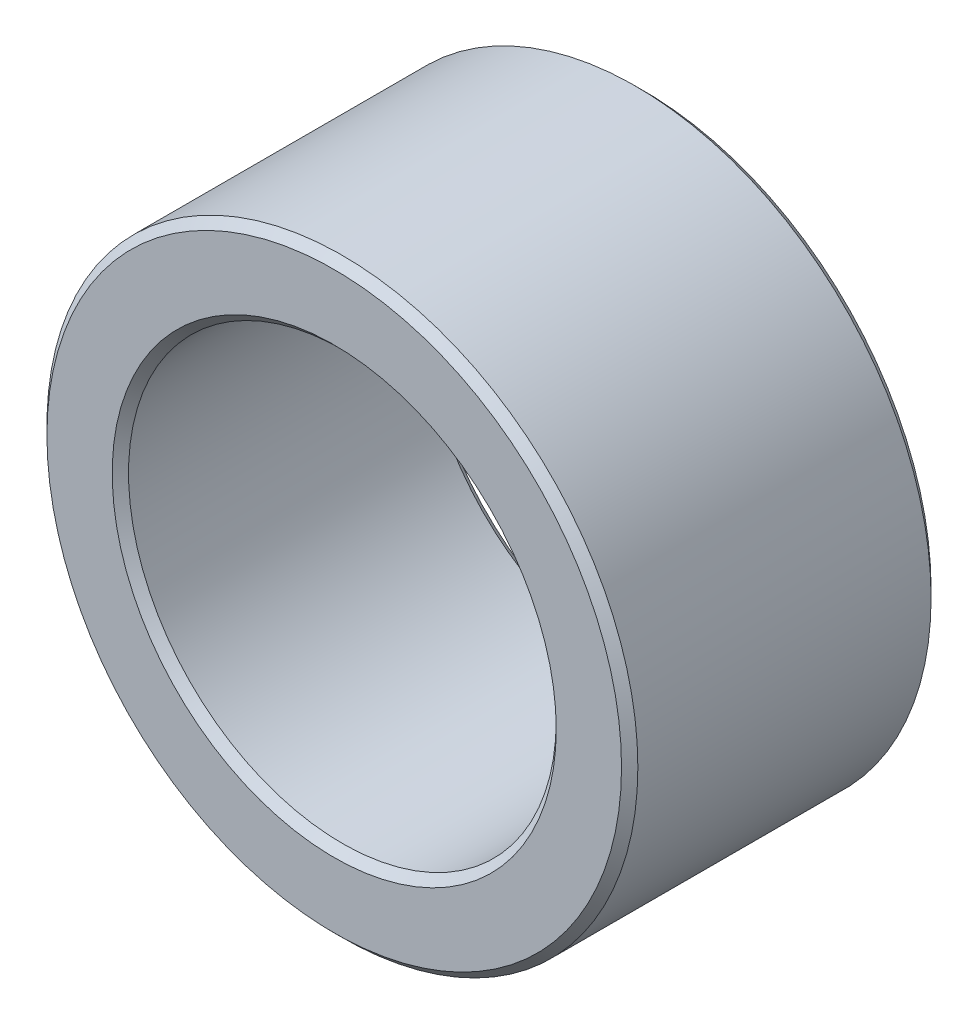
ISO-10303-21;
HEADER;
FILE_DESCRIPTION(('STEP AP214'),'2;1');
FILE_NAME('part.step','',(''),(''),'','','');
FILE_SCHEMA(('AUTOMOTIVE_DESIGN { 1 0 10303 214 1 1 1 1 }'));
ENDSEC;
DATA;
#1=APPLICATION_CONTEXT('core data for automotive mechanical design processes');
#2=APPLICATION_PROTOCOL_DEFINITION('international standard','automotive_design',2000,#1);
#3=PRODUCT_CONTEXT('',#1,'mechanical');
#4=PRODUCT('Part','Part','',(#3));
#5=PRODUCT_RELATED_PRODUCT_CATEGORY('part','',(#4));
#6=PRODUCT_DEFINITION_FORMATION('','',#4);
#7=PRODUCT_DEFINITION_CONTEXT('part definition',#1,'design');
#8=PRODUCT_DEFINITION('design','',#6,#7);
#9=PRODUCT_DEFINITION_SHAPE('','',#8);
#10=(LENGTH_UNIT() NAMED_UNIT(*) SI_UNIT(.MILLI.,.METRE.));
#11=(NAMED_UNIT(*) PLANE_ANGLE_UNIT() SI_UNIT($,.RADIAN.));
#12=(NAMED_UNIT(*) SI_UNIT($,.STERADIAN.) SOLID_ANGLE_UNIT());
#13=UNCERTAINTY_MEASURE_WITH_UNIT(LENGTH_MEASURE(1.E-05),#10,'distance_accuracy_value','');
#14=(GEOMETRIC_REPRESENTATION_CONTEXT(3) GLOBAL_UNCERTAINTY_ASSIGNED_CONTEXT((#13)) GLOBAL_UNIT_ASSIGNED_CONTEXT((#10,
#11,#12)) REPRESENTATION_CONTEXT('',''));
#15=CARTESIAN_POINT('',(0.,0.,0.));
#16=DIRECTION('',(0.,0.,1.));
#17=DIRECTION('',(1.,0.,0.));
#18=AXIS2_PLACEMENT_3D('',#15,#16,#17);
#19=CARTESIAN_POINT('',(0.,0.,-3.4925));
#20=DIRECTION('',(0.,0.,1.));
#21=DIRECTION('',(1.,0.,0.));
#22=AXIS2_PLACEMENT_3D('',#19,#20,#21);
#23=CYLINDRICAL_SURFACE('',#22,6.6675);
#24=CARTESIAN_POINT('',(0.,0.,3.30835));
#25=DIRECTION('',(0.,0.,1.));
#26=DIRECTION('',(1.,0.,0.));
#27=AXIS2_PLACEMENT_3D('',#24,#25,#26);
#28=CIRCLE('',#27,6.6675);
#29=CARTESIAN_POINT('',(6.6675,0.,3.30835));
#30=VERTEX_POINT('',#29);
#31=EDGE_CURVE('E62',#30,#30,#28,.F.);
#32=ORIENTED_EDGE('',*,*,#31,.T.);
#33=EDGE_LOOP('',(#32));
#34=FACE_BOUND('',#33,.T.);
#35=CARTESIAN_POINT('',(0.,0.,-3.30835));
#36=DIRECTION('',(0.,0.,1.));
#37=DIRECTION('',(1.,0.,0.));
#38=AXIS2_PLACEMENT_3D('',#35,#36,#37);
#39=CIRCLE('',#38,6.6675);
#40=CARTESIAN_POINT('',(6.6675,0.,-3.30835));
#41=VERTEX_POINT('',#40);
#42=EDGE_CURVE('E65',#41,#41,#39,.T.);
#43=ORIENTED_EDGE('',*,*,#42,.T.);
#44=EDGE_LOOP('',(#43));
#45=FACE_BOUND('',#44,.T.);
#46=ADVANCED_FACE('F42',(#34,#45),#23,.T.);
#47=CARTESIAN_POINT('',(0.,0.,-3.4925));
#48=DIRECTION('',(0.,0.,1.));
#49=DIRECTION('',(1.,0.,0.));
#50=AXIS2_PLACEMENT_3D('',#47,#48,#49);
#51=PLANE('',#50);
#52=CARTESIAN_POINT('',(0.,0.,-3.4925));
#53=DIRECTION('',(0.,0.,1.));
#54=DIRECTION('',(1.,0.,0.));
#55=AXIS2_PLACEMENT_3D('',#52,#53,#54);
#56=CIRCLE('',#55,6.48335);
#57=CARTESIAN_POINT('',(6.48335,0.,-3.4925));
#58=VERTEX_POINT('',#57);
#59=EDGE_CURVE('E53',#58,#58,#56,.F.);
#60=ORIENTED_EDGE('',*,*,#59,.T.);
#61=EDGE_LOOP('',(#60));
#62=FACE_BOUND('',#61,.T.);
#63=CARTESIAN_POINT('',(0.,0.,-3.4925));
#64=DIRECTION('',(0.,0.,1.));
#65=DIRECTION('',(1.,0.,0.));
#66=AXIS2_PLACEMENT_3D('',#63,#64,#65);
#67=CIRCLE('',#66,5.01015);
#68=CARTESIAN_POINT('',(5.01015,0.,-3.4925));
#69=VERTEX_POINT('',#68);
#70=EDGE_CURVE('E57',#69,#69,#67,.T.);
#71=ORIENTED_EDGE('',*,*,#70,.T.);
#72=EDGE_LOOP('',(#71));
#73=FACE_BOUND('',#72,.T.);
#74=ADVANCED_FACE('F90',(#62,#73),#51,.F.);
#75=CARTESIAN_POINT('',(0.,0.,-3.4925));
#76=DIRECTION('',(0.,0.,1.));
#77=DIRECTION('',(1.,0.,0.));
#78=AXIS2_PLACEMENT_3D('',#75,#76,#77);
#79=CYLINDRICAL_SURFACE('',#78,4.826);
#80=CARTESIAN_POINT('',(0.,0.,3.30835));
#81=DIRECTION('',(0.,0.,1.));
#82=DIRECTION('',(1.,0.,0.));
#83=AXIS2_PLACEMENT_3D('',#80,#81,#82);
#84=CIRCLE('',#83,4.826);
#85=CARTESIAN_POINT('',(4.826,0.,3.30835));
#86=VERTEX_POINT('',#85);
#87=EDGE_CURVE('E10',#86,#86,#84,.T.);
#88=ORIENTED_EDGE('',*,*,#87,.T.);
#89=EDGE_LOOP('',(#88));
#90=FACE_BOUND('',#89,.T.);
#91=CARTESIAN_POINT('',(0.,0.,-3.30835));
#92=DIRECTION('',(0.,0.,1.));
#93=DIRECTION('',(1.,0.,0.));
#94=AXIS2_PLACEMENT_3D('',#91,#92,#93);
#95=CIRCLE('',#94,4.826);
#96=CARTESIAN_POINT('',(4.826,0.,-3.30835));
#97=VERTEX_POINT('',#96);
#98=EDGE_CURVE('E49',#97,#97,#95,.F.);
#99=ORIENTED_EDGE('',*,*,#98,.T.);
#100=EDGE_LOOP('',(#99));
#101=FACE_BOUND('',#100,.T.);
#102=ADVANCED_FACE('F96',(#90,#101),#79,.F.);
#103=CARTESIAN_POINT('',(0.,0.,3.4925));
#104=DIRECTION('',(0.,0.,1.));
#105=DIRECTION('',(1.,0.,0.));
#106=AXIS2_PLACEMENT_3D('',#103,#104,#105);
#107=PLANE('',#106);
#108=CARTESIAN_POINT('',(0.,0.,3.4925));
#109=DIRECTION('',(0.,0.,1.));
#110=DIRECTION('',(1.,0.,0.));
#111=AXIS2_PLACEMENT_3D('',#108,#109,#110);
#112=CIRCLE('',#111,6.48335);
#113=CARTESIAN_POINT('',(6.48335,0.,3.4925));
#114=VERTEX_POINT('',#113);
#115=EDGE_CURVE('E68',#114,#114,#112,.T.);
#116=ORIENTED_EDGE('',*,*,#115,.T.);
#117=EDGE_LOOP('',(#116));
#118=FACE_BOUND('',#117,.T.);
#119=CARTESIAN_POINT('',(0.,0.,3.4925));
#120=DIRECTION('',(0.,0.,1.));
#121=DIRECTION('',(1.,0.,0.));
#122=AXIS2_PLACEMENT_3D('',#119,#120,#121);
#123=CIRCLE('',#122,5.01015);
#124=CARTESIAN_POINT('',(5.01015,0.,3.4925));
#125=VERTEX_POINT('',#124);
#126=EDGE_CURVE('E71',#125,#125,#123,.F.);
#127=ORIENTED_EDGE('',*,*,#126,.T.);
#128=EDGE_LOOP('',(#127));
#129=FACE_BOUND('',#128,.T.);
#130=ADVANCED_FACE('F75',(#118,#129),#107,.T.);
#131=CARTESIAN_POINT('',(0.,0.,3.4925));
#132=DIRECTION('',(0.,0.,-1.));
#133=DIRECTION('',(-1.,0.,0.));
#134=AXIS2_PLACEMENT_3D('',#131,#132,#133);
#135=CONICAL_SURFACE('',#134,6.48335,0.785398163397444);
#136=ORIENTED_EDGE('',*,*,#31,.F.);
#137=EDGE_LOOP('',(#136));
#138=FACE_BOUND('',#137,.T.);
#139=ORIENTED_EDGE('',*,*,#115,.F.);
#140=EDGE_LOOP('',(#139));
#141=FACE_BOUND('',#140,.T.);
#142=ADVANCED_FACE('F86',(#138,#141),#135,.T.);
#143=CARTESIAN_POINT('',(0.,0.,-3.30835));
#144=DIRECTION('',(0.,0.,1.));
#145=DIRECTION('',(1.,0.,0.));
#146=AXIS2_PLACEMENT_3D('',#143,#144,#145);
#147=CONICAL_SURFACE('',#146,6.6675,0.785398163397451);
#148=ORIENTED_EDGE('',*,*,#59,.F.);
#149=EDGE_LOOP('',(#148));
#150=FACE_BOUND('',#149,.T.);
#151=ORIENTED_EDGE('',*,*,#42,.F.);
#152=EDGE_LOOP('',(#151));
#153=FACE_BOUND('',#152,.T.);
#154=ADVANCED_FACE('F80',(#150,#153),#147,.T.);
#155=CARTESIAN_POINT('',(0.,0.,3.30835));
#156=DIRECTION('',(0.,0.,1.));
#157=DIRECTION('',(1.,0.,0.));
#158=AXIS2_PLACEMENT_3D('',#155,#156,#157);
#159=CONICAL_SURFACE('',#158,4.826,0.785398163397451);
#160=CARTESIAN_POINT('',(5.01015,0.,3.4925));
#161=CARTESIAN_POINT('',(5.00823177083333,0.,3.49058177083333));
#162=CARTESIAN_POINT('',(5.00631354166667,0.,3.48866354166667));
#163=CARTESIAN_POINT('',(5.00247708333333,0.,3.48482708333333));
#164=CARTESIAN_POINT('',(5.00055885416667,0.,3.48290885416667));
#165=CARTESIAN_POINT('',(4.99672239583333,0.,3.47907239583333));
#166=CARTESIAN_POINT('',(4.99480416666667,0.,3.47715416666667));
#167=CARTESIAN_POINT('',(4.99096770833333,0.,3.47331770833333));
#168=CARTESIAN_POINT('',(4.98904947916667,0.,3.47139947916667));
#169=CARTESIAN_POINT('',(4.98521302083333,0.,3.46756302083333));
#170=CARTESIAN_POINT('',(4.98329479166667,0.,3.46564479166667));
#171=CARTESIAN_POINT('',(4.97945833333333,0.,3.46180833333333));
#172=CARTESIAN_POINT('',(4.97754010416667,0.,3.45989010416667));
#173=CARTESIAN_POINT('',(4.97370364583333,0.,3.45605364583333));
#174=CARTESIAN_POINT('',(4.97178541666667,0.,3.45413541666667));
#175=CARTESIAN_POINT('',(4.96794895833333,0.,3.45029895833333));
#176=CARTESIAN_POINT('',(4.96603072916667,0.,3.44838072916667));
#177=CARTESIAN_POINT('',(4.96219427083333,0.,3.44454427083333));
#178=CARTESIAN_POINT('',(4.96027604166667,0.,3.44262604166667));
#179=CARTESIAN_POINT('',(4.95643958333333,0.,3.43878958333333));
#180=CARTESIAN_POINT('',(4.95452135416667,0.,3.43687135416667));
#181=CARTESIAN_POINT('',(4.95068489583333,0.,3.43303489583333));
#182=CARTESIAN_POINT('',(4.94876666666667,0.,3.43111666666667));
#183=CARTESIAN_POINT('',(4.94493020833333,0.,3.42728020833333));
#184=CARTESIAN_POINT('',(4.94301197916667,0.,3.42536197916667));
#185=CARTESIAN_POINT('',(4.93917552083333,0.,3.42152552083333));
#186=CARTESIAN_POINT('',(4.93725729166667,0.,3.41960729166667));
#187=CARTESIAN_POINT('',(4.93342083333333,0.,3.41577083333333));
#188=CARTESIAN_POINT('',(4.93150260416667,0.,3.41385260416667));
#189=CARTESIAN_POINT('',(4.92766614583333,0.,3.41001614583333));
#190=CARTESIAN_POINT('',(4.92574791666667,0.,3.40809791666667));
#191=CARTESIAN_POINT('',(4.92191145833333,0.,3.40426145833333));
#192=CARTESIAN_POINT('',(4.91999322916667,0.,3.40234322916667));
#193=CARTESIAN_POINT('',(4.91615677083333,0.,3.39850677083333));
#194=CARTESIAN_POINT('',(4.91423854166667,0.,3.39658854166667));
#195=CARTESIAN_POINT('',(4.91040208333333,0.,3.39275208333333));
#196=CARTESIAN_POINT('',(4.90848385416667,0.,3.39083385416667));
#197=CARTESIAN_POINT('',(4.90464739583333,0.,3.38699739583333));
#198=CARTESIAN_POINT('',(4.90272916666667,0.,3.38507916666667));
#199=CARTESIAN_POINT('',(4.89889270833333,0.,3.38124270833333));
#200=CARTESIAN_POINT('',(4.89697447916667,0.,3.37932447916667));
#201=CARTESIAN_POINT('',(4.89313802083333,0.,3.37548802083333));
#202=CARTESIAN_POINT('',(4.89121979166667,0.,3.37356979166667));
#203=CARTESIAN_POINT('',(4.88738333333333,0.,3.36973333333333));
#204=CARTESIAN_POINT('',(4.88546510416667,0.,3.36781510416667));
#205=CARTESIAN_POINT('',(4.88162864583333,0.,3.36397864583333));
#206=CARTESIAN_POINT('',(4.87971041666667,0.,3.36206041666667));
#207=CARTESIAN_POINT('',(4.87587395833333,0.,3.35822395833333));
#208=CARTESIAN_POINT('',(4.87395572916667,0.,3.35630572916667));
#209=CARTESIAN_POINT('',(4.87011927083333,0.,3.35246927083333));
#210=CARTESIAN_POINT('',(4.86820104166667,0.,3.35055104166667));
#211=CARTESIAN_POINT('',(4.86436458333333,0.,3.34671458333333));
#212=CARTESIAN_POINT('',(4.86244635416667,0.,3.34479635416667));
#213=CARTESIAN_POINT('',(4.85860989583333,0.,3.34095989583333));
#214=CARTESIAN_POINT('',(4.85669166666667,0.,3.33904166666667));
#215=CARTESIAN_POINT('',(4.85285520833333,0.,3.33520520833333));
#216=CARTESIAN_POINT('',(4.85093697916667,0.,3.33328697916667));
#217=CARTESIAN_POINT('',(4.84710052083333,0.,3.32945052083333));
#218=CARTESIAN_POINT('',(4.84518229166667,0.,3.32753229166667));
#219=CARTESIAN_POINT('',(4.84134583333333,0.,3.32369583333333));
#220=CARTESIAN_POINT('',(4.83942760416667,0.,3.32177760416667));
#221=CARTESIAN_POINT('',(4.83559114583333,0.,3.31794114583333));
#222=CARTESIAN_POINT('',(4.83367291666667,0.,3.31602291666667));
#223=CARTESIAN_POINT('',(4.82983645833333,0.,3.31218645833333));
#224=CARTESIAN_POINT('',(4.82791822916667,0.,3.31026822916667));
#225=CARTESIAN_POINT('',(4.826,0.,3.30835));
#226=B_SPLINE_CURVE_WITH_KNOTS('',3,(#160,#161,#162,#163,#164,#165,#166,#167,#168,#169,#170,
#171,#172,#173,#174,#175,#176,#177,#178,#179,#180,#181,#182,#183,#184,#185,#186,#187,#188,#189,
#190,#191,#192,#193,#194,#195,#196,#197,#198,#199,#200,#201,#202,#203,#204,#205,#206,#207,#208,
#209,#210,#211,#212,#213,#214,#215,#216,#217,#218,#219,#220,#221,#222,#223,#224,#225),
.UNSPECIFIED.,.F.,.F.,(4,2,2,2,2,2,2,2,2,2,2,2,2,2,2,2,2,2,2,2,2,2,2,2,2,2,2,2,2,2,2,2,4),(0.,
0.00813835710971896,0.0162767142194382,0.0244150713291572,0.0325534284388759,0.0406917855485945,
0.0488301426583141,0.0569684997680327,0.0651068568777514,0.0732452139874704,0.081383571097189,
0.0895219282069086,0.0976602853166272,0.105798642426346,0.113936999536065,0.122075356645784,
0.130213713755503,0.138352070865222,0.14649042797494,0.154628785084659,0.162767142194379,
0.170905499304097,0.179043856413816,0.187182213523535,0.195320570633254,0.203458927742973,
0.211597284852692,0.219735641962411,0.227873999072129,0.236012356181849,0.244150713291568,
0.252289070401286,0.260427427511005),.UNSPECIFIED.);
#227=EDGE_CURVE('BSEAM77',#125,#86,#226,.T.);
#228=ORIENTED_EDGE('',*,*,#126,.F.);
#229=ORIENTED_EDGE('',*,*,#87,.F.);
#230=ORIENTED_EDGE('',*,*,#227,.T.);
#231=ORIENTED_EDGE('',*,*,#227,.F.);
#232=EDGE_LOOP('',(#228,#230,#229,#231));
#233=FACE_BOUND('',#232,.T.);
#234=ADVANCED_FACE('F77',(#233),#159,.F.);
#235=CARTESIAN_POINT('',(0.,0.,-3.4925));
#236=DIRECTION('',(0.,0.,-1.));
#237=DIRECTION('',(-1.,0.,0.));
#238=AXIS2_PLACEMENT_3D('',#235,#236,#237);
#239=CONICAL_SURFACE('',#238,5.01015,0.785398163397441);
#240=ORIENTED_EDGE('',*,*,#98,.F.);
#241=EDGE_LOOP('',(#240));
#242=FACE_BOUND('',#241,.T.);
#243=ORIENTED_EDGE('',*,*,#70,.F.);
#244=EDGE_LOOP('',(#243));
#245=FACE_BOUND('',#244,.T.);
#246=ADVANCED_FACE('F44',(#242,#245),#239,.F.);
#247=CLOSED_SHELL('',(#46,#74,#102,#130,#142,#154,#234,#246));
#248=MANIFOLD_SOLID_BREP('B2',#247);
#249=ADVANCED_BREP_SHAPE_REPRESENTATION('',(#18,#248),#14);
#250=SHAPE_DEFINITION_REPRESENTATION(#9,#249);
ENDSEC;
END-ISO-10303-21;
